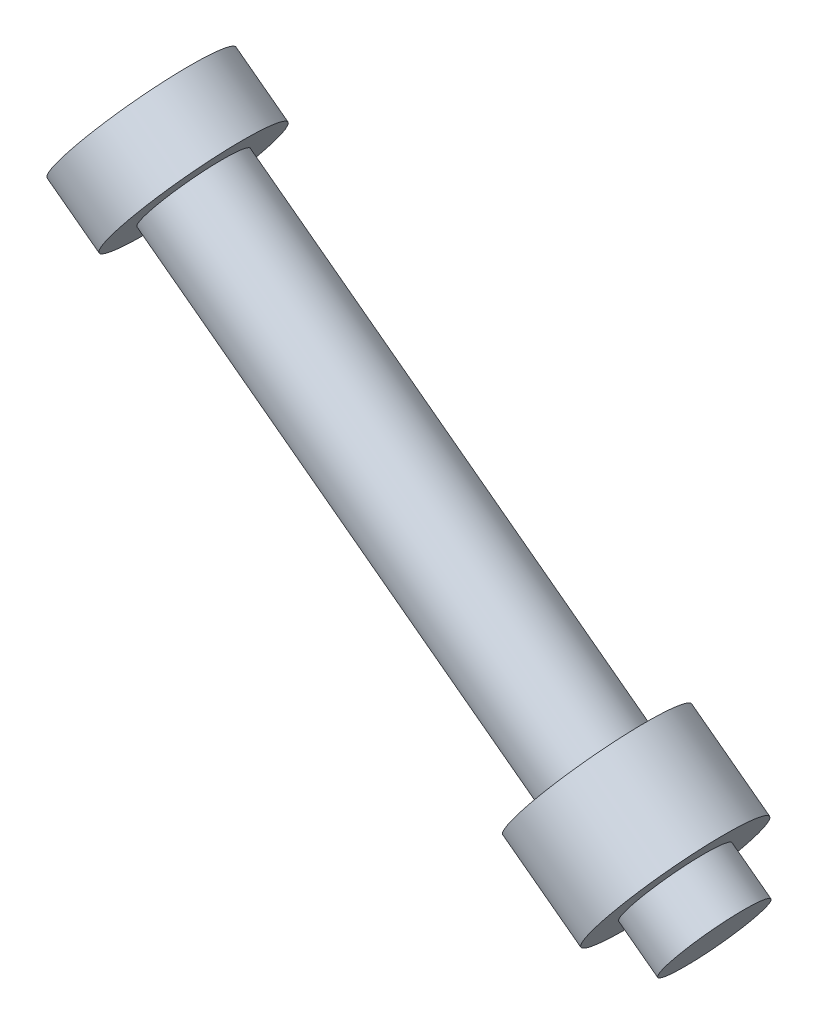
from build123d import *

# Parameters (mm, degrees)
CABEZA_PROFILE_R  = 5
VASTAGO_PROFILE_R = 3
TUERCA_PROFILE_R  = 5


with BuildPart() as part:
    # Cabeza: sweep along a curve in space
    with BuildLine() as cabeza_path:
        Line((-234.974862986, 359.135649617, 0), (-238.177480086, 361.53215618, 0))
    # Cabeza profile (on start of the path) → Cabeza (sweep)
    with BuildSketch(Plane(origin=(-234.974862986, 359.135649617, 0), x_dir=(-0.5991266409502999, -0.8006542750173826, 0), z_dir=(-0.8006542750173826, 0.5991266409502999, 0))):
        Circle(CABEZA_PROFILE_R)
    sweep(path=cabeza_path.line)

    # Vastago: sweep along a curve in space
    with BuildLine() as vastago_path:
        Line((-202.948691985, 335.170583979, 0), (-234.974862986, 359.135649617, 0))
    # Vastago profile (on start of the path) → Vastago (sweep)
    with BuildSketch(Plane(origin=(-202.948691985, 335.170583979, 0), x_dir=(-0.5991266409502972, -0.8006542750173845, 0), z_dir=(-0.8006542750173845, 0.5991266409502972, 0))):
        Circle(VASTAGO_PROFILE_R)
    sweep(path=vastago_path.line)

    # Tuerca: sweep along a curve in space
    with BuildLine() as tuerca_path:
        Line((-205.35065481, 336.967963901, 0), (-210.15458046, 340.562723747, 0))
    # Tuerca profile (on start of the path) → Tuerca (sweep)
    with BuildSketch(Plane(origin=(-205.35065481, 336.967963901, 0), x_dir=(-0.5991266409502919, -0.8006542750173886, 0), z_dir=(-0.8006542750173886, 0.5991266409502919, 0))):
        Circle(TUERCA_PROFILE_R)
    sweep(path=tuerca_path.line)


solid = part.part
